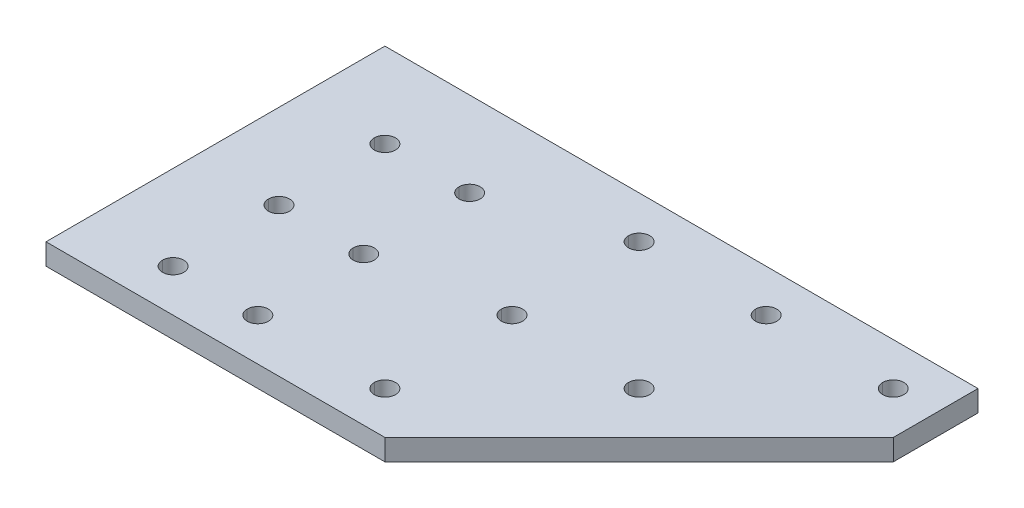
ISO-10303-21;
HEADER;
FILE_DESCRIPTION(('STEP AP214'),'2;1');
FILE_NAME('part.step','',(''),(''),'','','');
FILE_SCHEMA(('AUTOMOTIVE_DESIGN { 1 0 10303 214 1 1 1 1 }'));
ENDSEC;
DATA;
#1=APPLICATION_CONTEXT('core data for automotive mechanical design processes');
#2=APPLICATION_PROTOCOL_DEFINITION('international standard','automotive_design',2000,#1);
#3=PRODUCT_CONTEXT('',#1,'mechanical');
#4=PRODUCT('Part','Part','',(#3));
#5=PRODUCT_RELATED_PRODUCT_CATEGORY('part','',(#4));
#6=PRODUCT_DEFINITION_FORMATION('','',#4);
#7=PRODUCT_DEFINITION_CONTEXT('part definition',#1,'design');
#8=PRODUCT_DEFINITION('design','',#6,#7);
#9=PRODUCT_DEFINITION_SHAPE('','',#8);
#10=(LENGTH_UNIT() NAMED_UNIT(*) SI_UNIT(.MILLI.,.METRE.));
#11=(NAMED_UNIT(*) PLANE_ANGLE_UNIT() SI_UNIT($,.RADIAN.));
#12=(NAMED_UNIT(*) SI_UNIT($,.STERADIAN.) SOLID_ANGLE_UNIT());
#13=UNCERTAINTY_MEASURE_WITH_UNIT(LENGTH_MEASURE(1.E-05),#10,'distance_accuracy_value','');
#14=(GEOMETRIC_REPRESENTATION_CONTEXT(3) GLOBAL_UNCERTAINTY_ASSIGNED_CONTEXT((#13)) GLOBAL_UNIT_ASSIGNED_CONTEXT((#10,
#11,#12)) REPRESENTATION_CONTEXT('',''));
#15=CARTESIAN_POINT('',(0.,0.,0.));
#16=DIRECTION('',(0.,0.,1.));
#17=DIRECTION('',(1.,0.,0.));
#18=AXIS2_PLACEMENT_3D('',#15,#16,#17);
#19=CARTESIAN_POINT('',(25.4,6.35,-101.6));
#20=DIRECTION('',(0.,-1.,0.));
#21=DIRECTION('',(0.,0.,-1.));
#22=AXIS2_PLACEMENT_3D('',#19,#20,#21);
#23=PLANE('',#22);
#24=CARTESIAN_POINT('',(152.4,6.35,-76.2));
#25=DIRECTION('',(0.,-1.,0.));
#26=DIRECTION('',(0.,0.,-1.));
#27=AXIS2_PLACEMENT_3D('',#24,#25,#26);
#28=CIRCLE('',#27,6.34999999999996);
#29=CARTESIAN_POINT('',(146.05,6.35,-76.2));
#30=VERTEX_POINT('',#29);
#31=CARTESIAN_POINT('',(158.75,6.35,-76.2));
#32=VERTEX_POINT('',#31);
#33=EDGE_CURVE('E257',#30,#32,#28,.T.);
#34=ORIENTED_EDGE('',*,*,#33,.T.);
#35=CARTESIAN_POINT('',(152.4,6.35,-76.2));
#36=DIRECTION('',(0.,-1.,0.));
#37=DIRECTION('',(0.,0.,-1.));
#38=AXIS2_PLACEMENT_3D('',#35,#36,#37);
#39=CIRCLE('',#38,6.34999999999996);
#40=EDGE_CURVE('E259',#32,#30,#39,.T.);
#41=ORIENTED_EDGE('',*,*,#40,.T.);
#42=EDGE_LOOP('',(#34,#41));
#43=FACE_BOUND('',#42,.T.);
#44=CARTESIAN_POINT('',(-127.,6.35,76.2));
#45=DIRECTION('',(0.,-1.,0.));
#46=DIRECTION('',(0.,0.,-1.));
#47=AXIS2_PLACEMENT_3D('',#44,#45,#46);
#48=CIRCLE('',#47,6.35);
#49=CARTESIAN_POINT('',(-133.35,6.35,76.2));
#50=VERTEX_POINT('',#49);
#51=CARTESIAN_POINT('',(-120.65,6.35,76.2));
#52=VERTEX_POINT('',#51);
#53=EDGE_CURVE('E254',#50,#52,#48,.T.);
#54=ORIENTED_EDGE('',*,*,#53,.T.);
#55=CARTESIAN_POINT('',(-127.,6.35,76.2));
#56=DIRECTION('',(0.,-1.,0.));
#57=DIRECTION('',(0.,0.,-1.));
#58=AXIS2_PLACEMENT_3D('',#55,#56,#57);
#59=CIRCLE('',#58,6.35);
#60=EDGE_CURVE('E251',#52,#50,#59,.T.);
#61=ORIENTED_EDGE('',*,*,#60,.T.);
#62=EDGE_LOOP('',(#54,#61));
#63=FACE_BOUND('',#62,.T.);
#64=CARTESIAN_POINT('',(0.,6.35,0.));
#65=DIRECTION('',(0.,-1.,0.));
#66=DIRECTION('',(0.,0.,-1.));
#67=AXIS2_PLACEMENT_3D('',#64,#65,#66);
#68=CIRCLE('',#67,6.35);
#69=CARTESIAN_POINT('',(-6.35,6.35,0.));
#70=VERTEX_POINT('',#69);
#71=CARTESIAN_POINT('',(6.35,6.35,0.));
#72=VERTEX_POINT('',#71);
#73=EDGE_CURVE('E248',#70,#72,#68,.T.);
#74=ORIENTED_EDGE('',*,*,#73,.T.);
#75=CARTESIAN_POINT('',(0.,6.35,0.));
#76=DIRECTION('',(0.,-1.,0.));
#77=DIRECTION('',(0.,0.,-1.));
#78=AXIS2_PLACEMENT_3D('',#75,#76,#77);
#79=CIRCLE('',#78,6.35);
#80=EDGE_CURVE('E245',#72,#70,#79,.T.);
#81=ORIENTED_EDGE('',*,*,#80,.T.);
#82=EDGE_LOOP('',(#74,#81));
#83=FACE_BOUND('',#82,.T.);
#84=CARTESIAN_POINT('',(-76.2,6.35,76.2));
#85=DIRECTION('',(0.,-1.,0.));
#86=DIRECTION('',(0.,0.,-1.));
#87=AXIS2_PLACEMENT_3D('',#84,#85,#86);
#88=CIRCLE('',#87,6.35);
#89=CARTESIAN_POINT('',(-82.55,6.35,76.2));
#90=VERTEX_POINT('',#89);
#91=CARTESIAN_POINT('',(-69.85,6.35,76.2));
#92=VERTEX_POINT('',#91);
#93=EDGE_CURVE('E242',#90,#92,#88,.T.);
#94=ORIENTED_EDGE('',*,*,#93,.T.);
#95=CARTESIAN_POINT('',(-76.2,6.35,76.2));
#96=DIRECTION('',(0.,-1.,0.));
#97=DIRECTION('',(0.,0.,-1.));
#98=AXIS2_PLACEMENT_3D('',#95,#96,#97);
#99=CIRCLE('',#98,6.35);
#100=EDGE_CURVE('E239',#92,#90,#99,.T.);
#101=ORIENTED_EDGE('',*,*,#100,.T.);
#102=EDGE_LOOP('',(#94,#101));
#103=FACE_BOUND('',#102,.T.);
#104=CARTESIAN_POINT('',(0.,6.35,76.2));
#105=DIRECTION('',(0.,-1.,0.));
#106=DIRECTION('',(0.,0.,-1.));
#107=AXIS2_PLACEMENT_3D('',#104,#105,#106);
#108=CIRCLE('',#107,6.35);
#109=CARTESIAN_POINT('',(-6.35,6.35,76.2));
#110=VERTEX_POINT('',#109);
#111=CARTESIAN_POINT('',(6.35,6.35,76.2));
#112=VERTEX_POINT('',#111);
#113=EDGE_CURVE('E236',#110,#112,#108,.T.);
#114=ORIENTED_EDGE('',*,*,#113,.T.);
#115=CARTESIAN_POINT('',(0.,6.35,76.2));
#116=DIRECTION('',(0.,-1.,0.));
#117=DIRECTION('',(0.,0.,-1.));
#118=AXIS2_PLACEMENT_3D('',#115,#116,#117);
#119=CIRCLE('',#118,6.35);
#120=EDGE_CURVE('E233',#112,#110,#119,.T.);
#121=ORIENTED_EDGE('',*,*,#120,.T.);
#122=EDGE_LOOP('',(#114,#121));
#123=FACE_BOUND('',#122,.T.);
#124=CARTESIAN_POINT('',(0.,6.35,-76.2));
#125=DIRECTION('',(0.,-1.,0.));
#126=DIRECTION('',(0.,0.,-1.));
#127=AXIS2_PLACEMENT_3D('',#124,#125,#126);
#128=CIRCLE('',#127,6.35);
#129=CARTESIAN_POINT('',(-6.35,6.35,-76.2));
#130=VERTEX_POINT('',#129);
#131=CARTESIAN_POINT('',(6.35,6.35,-76.2));
#132=VERTEX_POINT('',#131);
#133=EDGE_CURVE('E230',#130,#132,#128,.T.);
#134=ORIENTED_EDGE('',*,*,#133,.T.);
#135=CARTESIAN_POINT('',(0.,6.35,-76.2));
#136=DIRECTION('',(0.,-1.,0.));
#137=DIRECTION('',(0.,0.,-1.));
#138=AXIS2_PLACEMENT_3D('',#135,#136,#137);
#139=CIRCLE('',#138,6.35);
#140=EDGE_CURVE('E226',#132,#130,#139,.T.);
#141=ORIENTED_EDGE('',*,*,#140,.T.);
#142=EDGE_LOOP('',(#134,#141));
#143=FACE_BOUND('',#142,.T.);
#144=DIRECTION('',(-1.,0.,0.));
#145=VECTOR('',#144,1.);
#146=CARTESIAN_POINT('',(228.6,6.35,-101.6));
#147=LINE('',#146,#145);
#148=CARTESIAN_POINT('',(-177.8,6.35,-101.6));
#149=VERTEX_POINT('',#148);
#150=CARTESIAN_POINT('',(177.8,6.35,-101.6));
#151=VERTEX_POINT('',#150);
#152=EDGE_CURVE('E229',#149,#151,#147,.F.);
#153=ORIENTED_EDGE('',*,*,#152,.F.);
#154=DIRECTION('',(0.,0.,1.));
#155=VECTOR('',#154,1.);
#156=CARTESIAN_POINT('',(-177.8,6.35,-101.6));
#157=LINE('',#156,#155);
#158=CARTESIAN_POINT('',(-177.8,6.35,101.6));
#159=VERTEX_POINT('',#158);
#160=EDGE_CURVE('E360',#159,#149,#157,.F.);
#161=ORIENTED_EDGE('',*,*,#160,.F.);
#162=DIRECTION('',(1.,0.,0.));
#163=VECTOR('',#162,1.);
#164=CARTESIAN_POINT('',(-177.8,6.35,101.6));
#165=LINE('',#164,#163);
#166=CARTESIAN_POINT('',(25.4,6.35,101.6));
#167=VERTEX_POINT('',#166);
#168=EDGE_CURVE('E354',#167,#159,#165,.F.);
#169=ORIENTED_EDGE('',*,*,#168,.F.);
#170=DIRECTION('',(0.707106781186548,0.,-0.707106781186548));
#171=VECTOR('',#170,1.);
#172=CARTESIAN_POINT('',(25.4,6.35000000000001,101.6));
#173=LINE('',#172,#171);
#174=CARTESIAN_POINT('',(177.8,6.35,-50.8));
#175=VERTEX_POINT('',#174);
#176=EDGE_CURVE('E351',#175,#167,#173,.F.);
#177=ORIENTED_EDGE('',*,*,#176,.F.);
#178=DIRECTION('',(0.,0.,-1.));
#179=VECTOR('',#178,1.);
#180=CARTESIAN_POINT('',(177.8,6.35,-63.5));
#181=LINE('',#180,#179);
#182=EDGE_CURVE('E344',#151,#175,#181,.F.);
#183=ORIENTED_EDGE('',*,*,#182,.F.);
#184=EDGE_LOOP('',(#153,#161,#169,#177,#183));
#185=FACE_BOUND('',#184,.T.);
#186=CARTESIAN_POINT('',(76.2,6.35,0.));
#187=DIRECTION('',(0.,1.,0.));
#188=DIRECTION('',(0.,0.,1.));
#189=AXIS2_PLACEMENT_3D('',#186,#187,#188);
#190=CIRCLE('',#189,6.35);
#191=CARTESIAN_POINT('',(82.55,6.35,0.));
#192=VERTEX_POINT('',#191);
#193=CARTESIAN_POINT('',(69.85,6.35,0.));
#194=VERTEX_POINT('',#193);
#195=EDGE_CURVE('E220',#192,#194,#190,.F.);
#196=ORIENTED_EDGE('',*,*,#195,.T.);
#197=CARTESIAN_POINT('',(76.2,6.35,0.));
#198=DIRECTION('',(0.,1.,0.));
#199=DIRECTION('',(0.,0.,1.));
#200=AXIS2_PLACEMENT_3D('',#197,#198,#199);
#201=CIRCLE('',#200,6.35);
#202=EDGE_CURVE('E222',#194,#192,#201,.F.);
#203=ORIENTED_EDGE('',*,*,#202,.T.);
#204=EDGE_LOOP('',(#196,#203));
#205=FACE_BOUND('',#204,.T.);
#206=CARTESIAN_POINT('',(76.2,6.35,-76.2));
#207=DIRECTION('',(0.,1.,0.));
#208=DIRECTION('',(0.,0.,1.));
#209=AXIS2_PLACEMENT_3D('',#206,#207,#208);
#210=CIRCLE('',#209,6.35);
#211=CARTESIAN_POINT('',(82.55,6.35,-76.2));
#212=VERTEX_POINT('',#211);
#213=CARTESIAN_POINT('',(69.85,6.35,-76.2));
#214=VERTEX_POINT('',#213);
#215=EDGE_CURVE('E214',#212,#214,#210,.F.);
#216=ORIENTED_EDGE('',*,*,#215,.T.);
#217=CARTESIAN_POINT('',(76.2,6.35,-76.2));
#218=DIRECTION('',(0.,1.,0.));
#219=DIRECTION('',(0.,0.,1.));
#220=AXIS2_PLACEMENT_3D('',#217,#218,#219);
#221=CIRCLE('',#220,6.35);
#222=EDGE_CURVE('E216',#214,#212,#221,.F.);
#223=ORIENTED_EDGE('',*,*,#222,.T.);
#224=EDGE_LOOP('',(#216,#223));
#225=FACE_BOUND('',#224,.T.);
#226=CARTESIAN_POINT('',(-127.,6.35,-50.8));
#227=DIRECTION('',(0.,1.,0.));
#228=DIRECTION('',(0.,0.,1.));
#229=AXIS2_PLACEMENT_3D('',#226,#227,#228);
#230=CIRCLE('',#229,6.35);
#231=CARTESIAN_POINT('',(-120.65,6.35,-50.8));
#232=VERTEX_POINT('',#231);
#233=CARTESIAN_POINT('',(-133.35,6.35,-50.8));
#234=VERTEX_POINT('',#233);
#235=EDGE_CURVE('E208',#232,#234,#230,.F.);
#236=ORIENTED_EDGE('',*,*,#235,.T.);
#237=CARTESIAN_POINT('',(-127.,6.35,-50.8));
#238=DIRECTION('',(0.,1.,0.));
#239=DIRECTION('',(0.,0.,1.));
#240=AXIS2_PLACEMENT_3D('',#237,#238,#239);
#241=CIRCLE('',#240,6.35);
#242=EDGE_CURVE('E210',#234,#232,#241,.F.);
#243=ORIENTED_EDGE('',*,*,#242,.T.);
#244=EDGE_LOOP('',(#236,#243));
#245=FACE_BOUND('',#244,.T.);
#246=CARTESIAN_POINT('',(-76.2,6.35,-50.8));
#247=DIRECTION('',(0.,1.,0.));
#248=DIRECTION('',(0.,0.,1.));
#249=AXIS2_PLACEMENT_3D('',#246,#247,#248);
#250=CIRCLE('',#249,6.35);
#251=CARTESIAN_POINT('',(-69.85,6.35,-50.8));
#252=VERTEX_POINT('',#251);
#253=CARTESIAN_POINT('',(-82.55,6.35,-50.8));
#254=VERTEX_POINT('',#253);
#255=EDGE_CURVE('E202',#252,#254,#250,.F.);
#256=ORIENTED_EDGE('',*,*,#255,.T.);
#257=CARTESIAN_POINT('',(-76.2,6.35,-50.8));
#258=DIRECTION('',(0.,1.,0.));
#259=DIRECTION('',(0.,0.,1.));
#260=AXIS2_PLACEMENT_3D('',#257,#258,#259);
#261=CIRCLE('',#260,6.35);
#262=EDGE_CURVE('E204',#254,#252,#261,.F.);
#263=ORIENTED_EDGE('',*,*,#262,.T.);
#264=EDGE_LOOP('',(#256,#263));
#265=FACE_BOUND('',#264,.T.);
#266=CARTESIAN_POINT('',(-127.,6.35,12.7));
#267=DIRECTION('',(0.,1.,0.));
#268=DIRECTION('',(0.,0.,1.));
#269=AXIS2_PLACEMENT_3D('',#266,#267,#268);
#270=CIRCLE('',#269,6.35);
#271=CARTESIAN_POINT('',(-120.65,6.35,12.7));
#272=VERTEX_POINT('',#271);
#273=CARTESIAN_POINT('',(-133.35,6.35,12.7));
#274=VERTEX_POINT('',#273);
#275=EDGE_CURVE('E192',#272,#274,#270,.F.);
#276=ORIENTED_EDGE('',*,*,#275,.T.);
#277=CARTESIAN_POINT('',(-127.,6.35,12.7));
#278=DIRECTION('',(0.,1.,0.));
#279=DIRECTION('',(0.,0.,1.));
#280=AXIS2_PLACEMENT_3D('',#277,#278,#279);
#281=CIRCLE('',#280,6.35);
#282=EDGE_CURVE('E199',#274,#272,#281,.F.);
#283=ORIENTED_EDGE('',*,*,#282,.T.);
#284=EDGE_LOOP('',(#276,#283));
#285=FACE_BOUND('',#284,.T.);
#286=CARTESIAN_POINT('',(-76.2,6.35,12.7));
#287=DIRECTION('',(0.,1.,0.));
#288=DIRECTION('',(0.,0.,1.));
#289=AXIS2_PLACEMENT_3D('',#286,#287,#288);
#290=CIRCLE('',#289,6.35);
#291=CARTESIAN_POINT('',(-69.85,6.35,12.7));
#292=VERTEX_POINT('',#291);
#293=CARTESIAN_POINT('',(-82.55,6.35,12.7));
#294=VERTEX_POINT('',#293);
#295=EDGE_CURVE('E19',#292,#294,#290,.F.);
#296=ORIENTED_EDGE('',*,*,#295,.T.);
#297=CARTESIAN_POINT('',(-76.2,6.35,12.7));
#298=DIRECTION('',(0.,1.,0.));
#299=DIRECTION('',(0.,0.,1.));
#300=AXIS2_PLACEMENT_3D('',#297,#298,#299);
#301=CIRCLE('',#300,6.35);
#302=EDGE_CURVE('E179',#294,#292,#301,.F.);
#303=ORIENTED_EDGE('',*,*,#302,.T.);
#304=EDGE_LOOP('',(#296,#303));
#305=FACE_BOUND('',#304,.T.);
#306=ADVANCED_FACE('F16',(#43,#63,#83,#103,#123,#143,#185,#205,#225,#245,#265,#285,#305),#23,.F.);
#307=CARTESIAN_POINT('',(-76.2,0.,12.7));
#308=DIRECTION('',(0.,1.,0.));
#309=DIRECTION('',(0.,0.,1.));
#310=AXIS2_PLACEMENT_3D('',#307,#308,#309);
#311=CYLINDRICAL_SURFACE('',#310,6.35);
#312=ORIENTED_EDGE('',*,*,#295,.F.);
#313=DIRECTION('',(0.,1.,0.));
#314=VECTOR('',#313,1.);
#315=CARTESIAN_POINT('',(-69.85,0.,12.7));
#316=LINE('',#315,#314);
#317=CARTESIAN_POINT('',(-69.85,-6.35,12.7));
#318=VERTEX_POINT('',#317);
#319=EDGE_CURVE('E193',#292,#318,#316,.F.);
#320=ORIENTED_EDGE('',*,*,#319,.T.);
#321=CARTESIAN_POINT('',(-76.2,-6.35,12.7));
#322=DIRECTION('',(0.,1.,0.));
#323=DIRECTION('',(0.,0.,1.));
#324=AXIS2_PLACEMENT_3D('',#321,#322,#323);
#325=CIRCLE('',#324,6.35);
#326=CARTESIAN_POINT('',(-82.55,-6.35,12.7));
#327=VERTEX_POINT('',#326);
#328=EDGE_CURVE('E188',#327,#318,#325,.T.);
#329=ORIENTED_EDGE('',*,*,#328,.F.);
#330=DIRECTION('',(0.,1.,0.));
#331=VECTOR('',#330,1.);
#332=CARTESIAN_POINT('',(-82.55,0.,12.7));
#333=LINE('',#332,#331);
#334=EDGE_CURVE('E185',#327,#294,#333,.T.);
#335=ORIENTED_EDGE('',*,*,#334,.T.);
#336=EDGE_LOOP('',(#312,#320,#329,#335));
#337=FACE_BOUND('',#336,.T.);
#338=ADVANCED_FACE('F186',(#337),#311,.F.);
#339=CARTESIAN_POINT('',(-76.2,0.,12.7));
#340=DIRECTION('',(0.,1.,0.));
#341=DIRECTION('',(0.,0.,1.));
#342=AXIS2_PLACEMENT_3D('',#339,#340,#341);
#343=CYLINDRICAL_SURFACE('',#342,6.35);
#344=CARTESIAN_POINT('',(-76.2,-6.35,12.7));
#345=DIRECTION('',(0.,1.,0.));
#346=DIRECTION('',(0.,0.,1.));
#347=AXIS2_PLACEMENT_3D('',#344,#345,#346);
#348=CIRCLE('',#347,6.35);
#349=EDGE_CURVE('E262',#318,#327,#348,.T.);
#350=ORIENTED_EDGE('',*,*,#349,.F.);
#351=ORIENTED_EDGE('',*,*,#319,.F.);
#352=ORIENTED_EDGE('',*,*,#302,.F.);
#353=ORIENTED_EDGE('',*,*,#334,.F.);
#354=EDGE_LOOP('',(#350,#351,#352,#353));
#355=FACE_BOUND('',#354,.T.);
#356=ADVANCED_FACE('F195',(#355),#343,.F.);
#357=CARTESIAN_POINT('',(-127.,0.,12.7));
#358=DIRECTION('',(0.,1.,0.));
#359=DIRECTION('',(0.,0.,1.));
#360=AXIS2_PLACEMENT_3D('',#357,#358,#359);
#361=CYLINDRICAL_SURFACE('',#360,6.35);
#362=ORIENTED_EDGE('',*,*,#275,.F.);
#363=DIRECTION('',(0.,1.,0.));
#364=VECTOR('',#363,1.);
#365=CARTESIAN_POINT('',(-120.65,0.,12.7));
#366=LINE('',#365,#364);
#367=CARTESIAN_POINT('',(-120.65,-6.35,12.7));
#368=VERTEX_POINT('',#367);
#369=EDGE_CURVE('E201',#272,#368,#366,.F.);
#370=ORIENTED_EDGE('',*,*,#369,.T.);
#371=CARTESIAN_POINT('',(-127.,-6.35,12.7));
#372=DIRECTION('',(0.,1.,0.));
#373=DIRECTION('',(0.,0.,1.));
#374=AXIS2_PLACEMENT_3D('',#371,#372,#373);
#375=CIRCLE('',#374,6.35);
#376=CARTESIAN_POINT('',(-133.35,-6.35,12.7));
#377=VERTEX_POINT('',#376);
#378=EDGE_CURVE('E265',#377,#368,#375,.T.);
#379=ORIENTED_EDGE('',*,*,#378,.F.);
#380=DIRECTION('',(0.,1.,0.));
#381=VECTOR('',#380,1.);
#382=CARTESIAN_POINT('',(-133.35,0.,12.7));
#383=LINE('',#382,#381);
#384=EDGE_CURVE('E205',#377,#274,#383,.T.);
#385=ORIENTED_EDGE('',*,*,#384,.T.);
#386=EDGE_LOOP('',(#362,#370,#379,#385));
#387=FACE_BOUND('',#386,.T.);
#388=ADVANCED_FACE('F557',(#387),#361,.F.);
#389=CARTESIAN_POINT('',(-127.,0.,12.7));
#390=DIRECTION('',(0.,1.,0.));
#391=DIRECTION('',(0.,0.,1.));
#392=AXIS2_PLACEMENT_3D('',#389,#390,#391);
#393=CYLINDRICAL_SURFACE('',#392,6.35);
#394=CARTESIAN_POINT('',(-127.,-6.35,12.7));
#395=DIRECTION('',(0.,1.,0.));
#396=DIRECTION('',(0.,0.,1.));
#397=AXIS2_PLACEMENT_3D('',#394,#395,#396);
#398=CIRCLE('',#397,6.35);
#399=EDGE_CURVE('E268',#368,#377,#398,.T.);
#400=ORIENTED_EDGE('',*,*,#399,.F.);
#401=ORIENTED_EDGE('',*,*,#369,.F.);
#402=ORIENTED_EDGE('',*,*,#282,.F.);
#403=ORIENTED_EDGE('',*,*,#384,.F.);
#404=EDGE_LOOP('',(#400,#401,#402,#403));
#405=FACE_BOUND('',#404,.T.);
#406=ADVANCED_FACE('F562',(#405),#393,.F.);
#407=CARTESIAN_POINT('',(-76.2,0.,-50.8));
#408=DIRECTION('',(0.,1.,0.));
#409=DIRECTION('',(0.,0.,1.));
#410=AXIS2_PLACEMENT_3D('',#407,#408,#409);
#411=CYLINDRICAL_SURFACE('',#410,6.35);
#412=ORIENTED_EDGE('',*,*,#255,.F.);
#413=DIRECTION('',(0.,1.,0.));
#414=VECTOR('',#413,1.);
#415=CARTESIAN_POINT('',(-69.85,0.,-50.8));
#416=LINE('',#415,#414);
#417=CARTESIAN_POINT('',(-69.85,-6.35,-50.8));
#418=VERTEX_POINT('',#417);
#419=EDGE_CURVE('E207',#252,#418,#416,.F.);
#420=ORIENTED_EDGE('',*,*,#419,.T.);
#421=CARTESIAN_POINT('',(-76.2,-6.35,-50.8));
#422=DIRECTION('',(0.,1.,0.));
#423=DIRECTION('',(0.,0.,1.));
#424=AXIS2_PLACEMENT_3D('',#421,#422,#423);
#425=CIRCLE('',#424,6.35);
#426=CARTESIAN_POINT('',(-82.55,-6.35,-50.8));
#427=VERTEX_POINT('',#426);
#428=EDGE_CURVE('E271',#427,#418,#425,.T.);
#429=ORIENTED_EDGE('',*,*,#428,.F.);
#430=DIRECTION('',(0.,1.,0.));
#431=VECTOR('',#430,1.);
#432=CARTESIAN_POINT('',(-82.55,0.,-50.8));
#433=LINE('',#432,#431);
#434=EDGE_CURVE('E211',#427,#254,#433,.T.);
#435=ORIENTED_EDGE('',*,*,#434,.T.);
#436=EDGE_LOOP('',(#412,#420,#429,#435));
#437=FACE_BOUND('',#436,.T.);
#438=ADVANCED_FACE('F566',(#437),#411,.F.);
#439=CARTESIAN_POINT('',(-76.2,0.,-50.8));
#440=DIRECTION('',(0.,1.,0.));
#441=DIRECTION('',(0.,0.,1.));
#442=AXIS2_PLACEMENT_3D('',#439,#440,#441);
#443=CYLINDRICAL_SURFACE('',#442,6.35);
#444=CARTESIAN_POINT('',(-76.2,-6.35,-50.8));
#445=DIRECTION('',(0.,1.,0.));
#446=DIRECTION('',(0.,0.,1.));
#447=AXIS2_PLACEMENT_3D('',#444,#445,#446);
#448=CIRCLE('',#447,6.35);
#449=EDGE_CURVE('E274',#418,#427,#448,.T.);
#450=ORIENTED_EDGE('',*,*,#449,.F.);
#451=ORIENTED_EDGE('',*,*,#419,.F.);
#452=ORIENTED_EDGE('',*,*,#262,.F.);
#453=ORIENTED_EDGE('',*,*,#434,.F.);
#454=EDGE_LOOP('',(#450,#451,#452,#453));
#455=FACE_BOUND('',#454,.T.);
#456=ADVANCED_FACE('F570',(#455),#443,.F.);
#457=CARTESIAN_POINT('',(-127.,0.,-50.8));
#458=DIRECTION('',(0.,1.,0.));
#459=DIRECTION('',(0.,0.,1.));
#460=AXIS2_PLACEMENT_3D('',#457,#458,#459);
#461=CYLINDRICAL_SURFACE('',#460,6.35);
#462=ORIENTED_EDGE('',*,*,#235,.F.);
#463=DIRECTION('',(0.,1.,0.));
#464=VECTOR('',#463,1.);
#465=CARTESIAN_POINT('',(-120.65,0.,-50.8));
#466=LINE('',#465,#464);
#467=CARTESIAN_POINT('',(-120.65,-6.35,-50.8));
#468=VERTEX_POINT('',#467);
#469=EDGE_CURVE('E213',#232,#468,#466,.F.);
#470=ORIENTED_EDGE('',*,*,#469,.T.);
#471=CARTESIAN_POINT('',(-127.,-6.35,-50.8));
#472=DIRECTION('',(0.,1.,0.));
#473=DIRECTION('',(0.,0.,1.));
#474=AXIS2_PLACEMENT_3D('',#471,#472,#473);
#475=CIRCLE('',#474,6.35);
#476=CARTESIAN_POINT('',(-133.35,-6.35,-50.8));
#477=VERTEX_POINT('',#476);
#478=EDGE_CURVE('E277',#477,#468,#475,.T.);
#479=ORIENTED_EDGE('',*,*,#478,.F.);
#480=DIRECTION('',(0.,1.,0.));
#481=VECTOR('',#480,1.);
#482=CARTESIAN_POINT('',(-133.35,0.,-50.8));
#483=LINE('',#482,#481);
#484=EDGE_CURVE('E217',#477,#234,#483,.T.);
#485=ORIENTED_EDGE('',*,*,#484,.T.);
#486=EDGE_LOOP('',(#462,#470,#479,#485));
#487=FACE_BOUND('',#486,.T.);
#488=ADVANCED_FACE('F574',(#487),#461,.F.);
#489=CARTESIAN_POINT('',(-127.,0.,-50.8));
#490=DIRECTION('',(0.,1.,0.));
#491=DIRECTION('',(0.,0.,1.));
#492=AXIS2_PLACEMENT_3D('',#489,#490,#491);
#493=CYLINDRICAL_SURFACE('',#492,6.35);
#494=CARTESIAN_POINT('',(-127.,-6.35,-50.8));
#495=DIRECTION('',(0.,1.,0.));
#496=DIRECTION('',(0.,0.,1.));
#497=AXIS2_PLACEMENT_3D('',#494,#495,#496);
#498=CIRCLE('',#497,6.35);
#499=EDGE_CURVE('E280',#468,#477,#498,.T.);
#500=ORIENTED_EDGE('',*,*,#499,.F.);
#501=ORIENTED_EDGE('',*,*,#469,.F.);
#502=ORIENTED_EDGE('',*,*,#242,.F.);
#503=ORIENTED_EDGE('',*,*,#484,.F.);
#504=EDGE_LOOP('',(#500,#501,#502,#503));
#505=FACE_BOUND('',#504,.T.);
#506=ADVANCED_FACE('F578',(#505),#493,.F.);
#507=CARTESIAN_POINT('',(76.2,0.,-76.2));
#508=DIRECTION('',(0.,1.,0.));
#509=DIRECTION('',(0.,0.,1.));
#510=AXIS2_PLACEMENT_3D('',#507,#508,#509);
#511=CYLINDRICAL_SURFACE('',#510,6.35);
#512=ORIENTED_EDGE('',*,*,#215,.F.);
#513=DIRECTION('',(0.,1.,0.));
#514=VECTOR('',#513,1.);
#515=CARTESIAN_POINT('',(82.55,0.,-76.2));
#516=LINE('',#515,#514);
#517=CARTESIAN_POINT('',(82.55,-6.35,-76.2));
#518=VERTEX_POINT('',#517);
#519=EDGE_CURVE('E219',#212,#518,#516,.F.);
#520=ORIENTED_EDGE('',*,*,#519,.T.);
#521=CARTESIAN_POINT('',(76.2,-6.35,-76.2));
#522=DIRECTION('',(0.,1.,0.));
#523=DIRECTION('',(0.,0.,1.));
#524=AXIS2_PLACEMENT_3D('',#521,#522,#523);
#525=CIRCLE('',#524,6.35);
#526=CARTESIAN_POINT('',(69.85,-6.35,-76.2));
#527=VERTEX_POINT('',#526);
#528=EDGE_CURVE('E283',#527,#518,#525,.T.);
#529=ORIENTED_EDGE('',*,*,#528,.F.);
#530=DIRECTION('',(0.,1.,0.));
#531=VECTOR('',#530,1.);
#532=CARTESIAN_POINT('',(69.85,0.,-76.2));
#533=LINE('',#532,#531);
#534=EDGE_CURVE('E223',#527,#214,#533,.T.);
#535=ORIENTED_EDGE('',*,*,#534,.T.);
#536=EDGE_LOOP('',(#512,#520,#529,#535));
#537=FACE_BOUND('',#536,.T.);
#538=ADVANCED_FACE('F582',(#537),#511,.F.);
#539=CARTESIAN_POINT('',(76.2,0.,-76.2));
#540=DIRECTION('',(0.,1.,0.));
#541=DIRECTION('',(0.,0.,1.));
#542=AXIS2_PLACEMENT_3D('',#539,#540,#541);
#543=CYLINDRICAL_SURFACE('',#542,6.35);
#544=CARTESIAN_POINT('',(76.2,-6.35,-76.2));
#545=DIRECTION('',(0.,1.,0.));
#546=DIRECTION('',(0.,0.,1.));
#547=AXIS2_PLACEMENT_3D('',#544,#545,#546);
#548=CIRCLE('',#547,6.35);
#549=EDGE_CURVE('E286',#518,#527,#548,.T.);
#550=ORIENTED_EDGE('',*,*,#549,.F.);
#551=ORIENTED_EDGE('',*,*,#519,.F.);
#552=ORIENTED_EDGE('',*,*,#222,.F.);
#553=ORIENTED_EDGE('',*,*,#534,.F.);
#554=EDGE_LOOP('',(#550,#551,#552,#553));
#555=FACE_BOUND('',#554,.T.);
#556=ADVANCED_FACE('F586',(#555),#543,.F.);
#557=CARTESIAN_POINT('',(76.2,0.,0.));
#558=DIRECTION('',(0.,1.,0.));
#559=DIRECTION('',(0.,0.,1.));
#560=AXIS2_PLACEMENT_3D('',#557,#558,#559);
#561=CYLINDRICAL_SURFACE('',#560,6.35);
#562=ORIENTED_EDGE('',*,*,#195,.F.);
#563=DIRECTION('',(0.,1.,0.));
#564=VECTOR('',#563,1.);
#565=CARTESIAN_POINT('',(82.55,0.,0.));
#566=LINE('',#565,#564);
#567=CARTESIAN_POINT('',(82.55,-6.35,0.));
#568=VERTEX_POINT('',#567);
#569=EDGE_CURVE('E225',#192,#568,#566,.F.);
#570=ORIENTED_EDGE('',*,*,#569,.T.);
#571=CARTESIAN_POINT('',(76.2,-6.35,0.));
#572=DIRECTION('',(0.,1.,0.));
#573=DIRECTION('',(0.,0.,1.));
#574=AXIS2_PLACEMENT_3D('',#571,#572,#573);
#575=CIRCLE('',#574,6.35);
#576=CARTESIAN_POINT('',(69.85,-6.35,0.));
#577=VERTEX_POINT('',#576);
#578=EDGE_CURVE('E289',#577,#568,#575,.T.);
#579=ORIENTED_EDGE('',*,*,#578,.F.);
#580=DIRECTION('',(0.,1.,0.));
#581=VECTOR('',#580,1.);
#582=CARTESIAN_POINT('',(69.85,0.,0.));
#583=LINE('',#582,#581);
#584=EDGE_CURVE('E341',#577,#194,#583,.T.);
#585=ORIENTED_EDGE('',*,*,#584,.T.);
#586=EDGE_LOOP('',(#562,#570,#579,#585));
#587=FACE_BOUND('',#586,.T.);
#588=ADVANCED_FACE('F590',(#587),#561,.F.);
#589=CARTESIAN_POINT('',(76.2,0.,0.));
#590=DIRECTION('',(0.,1.,0.));
#591=DIRECTION('',(0.,0.,1.));
#592=AXIS2_PLACEMENT_3D('',#589,#590,#591);
#593=CYLINDRICAL_SURFACE('',#592,6.35);
#594=CARTESIAN_POINT('',(76.2,-6.35,0.));
#595=DIRECTION('',(0.,1.,0.));
#596=DIRECTION('',(0.,0.,1.));
#597=AXIS2_PLACEMENT_3D('',#594,#595,#596);
#598=CIRCLE('',#597,6.35);
#599=EDGE_CURVE('E292',#568,#577,#598,.T.);
#600=ORIENTED_EDGE('',*,*,#599,.F.);
#601=ORIENTED_EDGE('',*,*,#569,.F.);
#602=ORIENTED_EDGE('',*,*,#202,.F.);
#603=ORIENTED_EDGE('',*,*,#584,.F.);
#604=EDGE_LOOP('',(#600,#601,#602,#603));
#605=FACE_BOUND('',#604,.T.);
#606=ADVANCED_FACE('F594',(#605),#593,.F.);
#607=CARTESIAN_POINT('',(177.8,0.,-63.5));
#608=DIRECTION('',(1.,0.,0.));
#609=DIRECTION('',(0.,0.,-1.));
#610=AXIS2_PLACEMENT_3D('',#607,#608,#609);
#611=PLANE('',#610);
#612=DIRECTION('',(0.,1.,0.));
#613=VECTOR('',#612,1.);
#614=CARTESIAN_POINT('',(177.8,-6.35,-101.6));
#615=LINE('',#614,#613);
#616=CARTESIAN_POINT('',(177.8,-6.35,-101.6));
#617=VERTEX_POINT('',#616);
#618=EDGE_CURVE('E366',#151,#617,#615,.F.);
#619=ORIENTED_EDGE('',*,*,#618,.F.);
#620=ORIENTED_EDGE('',*,*,#182,.T.);
#621=DIRECTION('',(0.,1.,0.));
#622=VECTOR('',#621,1.);
#623=CARTESIAN_POINT('',(177.8,-6.35,-50.8));
#624=LINE('',#623,#622);
#625=CARTESIAN_POINT('',(177.8,-6.35,-50.8));
#626=VERTEX_POINT('',#625);
#627=EDGE_CURVE('E348',#626,#175,#624,.T.);
#628=ORIENTED_EDGE('',*,*,#627,.F.);
#629=DIRECTION('',(0.,0.,-1.));
#630=VECTOR('',#629,1.);
#631=CARTESIAN_POINT('',(177.8,-6.35,-33.8666666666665));
#632=LINE('',#631,#630);
#633=EDGE_CURVE('E295',#617,#626,#632,.F.);
#634=ORIENTED_EDGE('',*,*,#633,.F.);
#635=EDGE_LOOP('',(#619,#620,#628,#634));
#636=FACE_BOUND('',#635,.T.);
#637=ADVANCED_FACE('F438',(#636),#611,.T.);
#638=CARTESIAN_POINT('',(25.4,-6.35,101.6));
#639=DIRECTION('',(0.707106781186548,0.,0.707106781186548));
#640=DIRECTION('',(0.707106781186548,0.,-0.707106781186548));
#641=AXIS2_PLACEMENT_3D('',#638,#639,#640);
#642=PLANE('',#641);
#643=DIRECTION('',(0.,1.,0.));
#644=VECTOR('',#643,1.);
#645=CARTESIAN_POINT('',(25.4,-6.35,101.6));
#646=LINE('',#645,#644);
#647=CARTESIAN_POINT('',(25.4,-6.35,101.6));
#648=VERTEX_POINT('',#647);
#649=EDGE_CURVE('E357',#648,#167,#646,.T.);
#650=ORIENTED_EDGE('',*,*,#649,.F.);
#651=DIRECTION('',(-0.707106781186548,0.,0.707106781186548));
#652=VECTOR('',#651,1.);
#653=CARTESIAN_POINT('',(177.8,-6.35,-50.8));
#654=LINE('',#653,#652);
#655=EDGE_CURVE('E394',#626,#648,#654,.T.);
#656=ORIENTED_EDGE('',*,*,#655,.F.);
#657=ORIENTED_EDGE('',*,*,#627,.T.);
#658=ORIENTED_EDGE('',*,*,#176,.T.);
#659=EDGE_LOOP('',(#650,#656,#657,#658));
#660=FACE_BOUND('',#659,.T.);
#661=ADVANCED_FACE('F444',(#660),#642,.T.);
#662=CARTESIAN_POINT('',(-177.8,-6.35,101.6));
#663=DIRECTION('',(0.,0.,1.));
#664=DIRECTION('',(1.,0.,0.));
#665=AXIS2_PLACEMENT_3D('',#662,#663,#664);
#666=PLANE('',#665);
#667=DIRECTION('',(1.,0.,0.));
#668=VECTOR('',#667,1.);
#669=CARTESIAN_POINT('',(93.1333333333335,-6.35,101.6));
#670=LINE('',#669,#668);
#671=CARTESIAN_POINT('',(-177.8,-6.35,101.6));
#672=VERTEX_POINT('',#671);
#673=EDGE_CURVE('E397',#648,#672,#670,.F.);
#674=ORIENTED_EDGE('',*,*,#673,.F.);
#675=ORIENTED_EDGE('',*,*,#649,.T.);
#676=ORIENTED_EDGE('',*,*,#168,.T.);
#677=DIRECTION('',(0.,1.,0.));
#678=VECTOR('',#677,1.);
#679=CARTESIAN_POINT('',(-177.8,-6.35,101.6));
#680=LINE('',#679,#678);
#681=EDGE_CURVE('E363',#672,#159,#680,.T.);
#682=ORIENTED_EDGE('',*,*,#681,.F.);
#683=EDGE_LOOP('',(#674,#675,#676,#682));
#684=FACE_BOUND('',#683,.T.);
#685=ADVANCED_FACE('F447',(#684),#666,.T.);
#686=CARTESIAN_POINT('',(-177.8,-6.35,-101.6));
#687=DIRECTION('',(-1.,0.,0.));
#688=DIRECTION('',(0.,0.,1.));
#689=AXIS2_PLACEMENT_3D('',#686,#687,#688);
#690=PLANE('',#689);
#691=DIRECTION('',(0.,0.,-1.));
#692=VECTOR('',#691,1.);
#693=CARTESIAN_POINT('',(-177.8,-6.35,-33.8666666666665));
#694=LINE('',#693,#692);
#695=CARTESIAN_POINT('',(-177.8,-6.35,-101.6));
#696=VERTEX_POINT('',#695);
#697=EDGE_CURVE('E400',#672,#696,#694,.T.);
#698=ORIENTED_EDGE('',*,*,#697,.F.);
#699=ORIENTED_EDGE('',*,*,#681,.T.);
#700=ORIENTED_EDGE('',*,*,#160,.T.);
#701=DIRECTION('',(0.,1.,0.));
#702=VECTOR('',#701,1.);
#703=CARTESIAN_POINT('',(-177.8,-6.35,-101.6));
#704=LINE('',#703,#702);
#705=EDGE_CURVE('E369',#696,#149,#704,.T.);
#706=ORIENTED_EDGE('',*,*,#705,.F.);
#707=EDGE_LOOP('',(#698,#699,#700,#706));
#708=FACE_BOUND('',#707,.T.);
#709=ADVANCED_FACE('F448',(#708),#690,.T.);
#710=CARTESIAN_POINT('',(228.6,-6.35,-101.6));
#711=DIRECTION('',(0.,0.,-1.));
#712=DIRECTION('',(-1.,0.,0.));
#713=AXIS2_PLACEMENT_3D('',#710,#711,#712);
#714=PLANE('',#713);
#715=ORIENTED_EDGE('',*,*,#705,.T.);
#716=ORIENTED_EDGE('',*,*,#152,.T.);
#717=ORIENTED_EDGE('',*,*,#618,.T.);
#718=DIRECTION('',(1.,0.,0.));
#719=VECTOR('',#718,1.);
#720=CARTESIAN_POINT('',(93.1333333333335,-6.35,-101.6));
#721=LINE('',#720,#719);
#722=EDGE_CURVE('E300',#696,#617,#721,.T.);
#723=ORIENTED_EDGE('',*,*,#722,.F.);
#724=EDGE_LOOP('',(#715,#716,#717,#723));
#725=FACE_BOUND('',#724,.T.);
#726=ADVANCED_FACE('F413',(#725),#714,.T.);
#727=CARTESIAN_POINT('',(0.,6.35,-76.2));
#728=DIRECTION('',(0.,-1.,0.));
#729=DIRECTION('',(0.,0.,-1.));
#730=AXIS2_PLACEMENT_3D('',#727,#728,#729);
#731=CYLINDRICAL_SURFACE('',#730,6.35);
#732=CARTESIAN_POINT('',(0.,-6.35,-76.2));
#733=DIRECTION('',(0.,-1.,0.));
#734=DIRECTION('',(0.,0.,-1.));
#735=AXIS2_PLACEMENT_3D('',#732,#733,#734);
#736=CIRCLE('',#735,6.35);
#737=CARTESIAN_POINT('',(-6.35,-6.35,-76.2));
#738=VERTEX_POINT('',#737);
#739=CARTESIAN_POINT('',(6.35,-6.35,-76.2));
#740=VERTEX_POINT('',#739);
#741=EDGE_CURVE('E296',#738,#740,#736,.F.);
#742=ORIENTED_EDGE('',*,*,#741,.F.);
#743=DIRECTION('',(0.,-1.,0.));
#744=VECTOR('',#743,1.);
#745=CARTESIAN_POINT('',(-6.35,6.35,-76.2));
#746=LINE('',#745,#744);
#747=EDGE_CURVE('E228',#738,#130,#746,.F.);
#748=ORIENTED_EDGE('',*,*,#747,.T.);
#749=ORIENTED_EDGE('',*,*,#140,.F.);
#750=DIRECTION('',(0.,-1.,0.));
#751=VECTOR('',#750,1.);
#752=CARTESIAN_POINT('',(6.35,6.35,-76.2));
#753=LINE('',#752,#751);
#754=EDGE_CURVE('E232',#132,#740,#753,.T.);
#755=ORIENTED_EDGE('',*,*,#754,.T.);
#756=EDGE_LOOP('',(#742,#748,#749,#755));
#757=FACE_BOUND('',#756,.T.);
#758=ADVANCED_FACE('F456',(#757),#731,.F.);
#759=CARTESIAN_POINT('',(0.,6.35,-76.2));
#760=DIRECTION('',(0.,-1.,0.));
#761=DIRECTION('',(0.,0.,-1.));
#762=AXIS2_PLACEMENT_3D('',#759,#760,#761);
#763=CYLINDRICAL_SURFACE('',#762,6.35);
#764=ORIENTED_EDGE('',*,*,#133,.F.);
#765=ORIENTED_EDGE('',*,*,#747,.F.);
#766=CARTESIAN_POINT('',(0.,-6.35,-76.2));
#767=DIRECTION('',(0.,-1.,0.));
#768=DIRECTION('',(0.,0.,-1.));
#769=AXIS2_PLACEMENT_3D('',#766,#767,#768);
#770=CIRCLE('',#769,6.35);
#771=EDGE_CURVE('E299',#740,#738,#770,.F.);
#772=ORIENTED_EDGE('',*,*,#771,.F.);
#773=ORIENTED_EDGE('',*,*,#754,.F.);
#774=EDGE_LOOP('',(#764,#765,#772,#773));
#775=FACE_BOUND('',#774,.T.);
#776=ADVANCED_FACE('F504',(#775),#763,.F.);
#777=CARTESIAN_POINT('',(0.,6.35,76.2));
#778=DIRECTION('',(0.,-1.,0.));
#779=DIRECTION('',(0.,0.,-1.));
#780=AXIS2_PLACEMENT_3D('',#777,#778,#779);
#781=CYLINDRICAL_SURFACE('',#780,6.35);
#782=CARTESIAN_POINT('',(0.,-6.35,76.2));
#783=DIRECTION('',(0.,-1.,0.));
#784=DIRECTION('',(0.,0.,-1.));
#785=AXIS2_PLACEMENT_3D('',#782,#783,#784);
#786=CIRCLE('',#785,6.35);
#787=CARTESIAN_POINT('',(-6.35,-6.35,76.2));
#788=VERTEX_POINT('',#787);
#789=CARTESIAN_POINT('',(6.35,-6.35,76.2));
#790=VERTEX_POINT('',#789);
#791=EDGE_CURVE('E303',#788,#790,#786,.F.);
#792=ORIENTED_EDGE('',*,*,#791,.F.);
#793=DIRECTION('',(0.,-1.,0.));
#794=VECTOR('',#793,1.);
#795=CARTESIAN_POINT('',(-6.35,6.35,76.2));
#796=LINE('',#795,#794);
#797=EDGE_CURVE('E235',#788,#110,#796,.F.);
#798=ORIENTED_EDGE('',*,*,#797,.T.);
#799=ORIENTED_EDGE('',*,*,#120,.F.);
#800=DIRECTION('',(0.,-1.,0.));
#801=VECTOR('',#800,1.);
#802=CARTESIAN_POINT('',(6.35,6.35,76.2));
#803=LINE('',#802,#801);
#804=EDGE_CURVE('E238',#112,#790,#803,.T.);
#805=ORIENTED_EDGE('',*,*,#804,.T.);
#806=EDGE_LOOP('',(#792,#798,#799,#805));
#807=FACE_BOUND('',#806,.T.);
#808=ADVANCED_FACE('F500',(#807),#781,.F.);
#809=CARTESIAN_POINT('',(0.,6.35,76.2));
#810=DIRECTION('',(0.,-1.,0.));
#811=DIRECTION('',(0.,0.,-1.));
#812=AXIS2_PLACEMENT_3D('',#809,#810,#811);
#813=CYLINDRICAL_SURFACE('',#812,6.35);
#814=ORIENTED_EDGE('',*,*,#113,.F.);
#815=ORIENTED_EDGE('',*,*,#797,.F.);
#816=CARTESIAN_POINT('',(0.,-6.35,76.2));
#817=DIRECTION('',(0.,-1.,0.));
#818=DIRECTION('',(0.,0.,-1.));
#819=AXIS2_PLACEMENT_3D('',#816,#817,#818);
#820=CIRCLE('',#819,6.35);
#821=EDGE_CURVE('E306',#790,#788,#820,.F.);
#822=ORIENTED_EDGE('',*,*,#821,.F.);
#823=ORIENTED_EDGE('',*,*,#804,.F.);
#824=EDGE_LOOP('',(#814,#815,#822,#823));
#825=FACE_BOUND('',#824,.T.);
#826=ADVANCED_FACE('F496',(#825),#813,.F.);
#827=CARTESIAN_POINT('',(-76.2,6.35,76.2));
#828=DIRECTION('',(0.,-1.,0.));
#829=DIRECTION('',(0.,0.,-1.));
#830=AXIS2_PLACEMENT_3D('',#827,#828,#829);
#831=CYLINDRICAL_SURFACE('',#830,6.35);
#832=CARTESIAN_POINT('',(-76.2,-6.35,76.2));
#833=DIRECTION('',(0.,-1.,0.));
#834=DIRECTION('',(0.,0.,-1.));
#835=AXIS2_PLACEMENT_3D('',#832,#833,#834);
#836=CIRCLE('',#835,6.35);
#837=CARTESIAN_POINT('',(-82.55,-6.35,76.2));
#838=VERTEX_POINT('',#837);
#839=CARTESIAN_POINT('',(-69.85,-6.35,76.2));
#840=VERTEX_POINT('',#839);
#841=EDGE_CURVE('E309',#838,#840,#836,.F.);
#842=ORIENTED_EDGE('',*,*,#841,.F.);
#843=DIRECTION('',(0.,-1.,0.));
#844=VECTOR('',#843,1.);
#845=CARTESIAN_POINT('',(-82.55,6.35,76.2));
#846=LINE('',#845,#844);
#847=EDGE_CURVE('E241',#838,#90,#846,.F.);
#848=ORIENTED_EDGE('',*,*,#847,.T.);
#849=ORIENTED_EDGE('',*,*,#100,.F.);
#850=DIRECTION('',(0.,-1.,0.));
#851=VECTOR('',#850,1.);
#852=CARTESIAN_POINT('',(-69.85,6.35,76.2));
#853=LINE('',#852,#851);
#854=EDGE_CURVE('E244',#92,#840,#853,.T.);
#855=ORIENTED_EDGE('',*,*,#854,.T.);
#856=EDGE_LOOP('',(#842,#848,#849,#855));
#857=FACE_BOUND('',#856,.T.);
#858=ADVANCED_FACE('F492',(#857),#831,.F.);
#859=CARTESIAN_POINT('',(-76.2,6.35,76.2));
#860=DIRECTION('',(0.,-1.,0.));
#861=DIRECTION('',(0.,0.,-1.));
#862=AXIS2_PLACEMENT_3D('',#859,#860,#861);
#863=CYLINDRICAL_SURFACE('',#862,6.35);
#864=ORIENTED_EDGE('',*,*,#93,.F.);
#865=ORIENTED_EDGE('',*,*,#847,.F.);
#866=CARTESIAN_POINT('',(-76.2,-6.35,76.2));
#867=DIRECTION('',(0.,-1.,0.));
#868=DIRECTION('',(0.,0.,-1.));
#869=AXIS2_PLACEMENT_3D('',#866,#867,#868);
#870=CIRCLE('',#869,6.35);
#871=EDGE_CURVE('E312',#840,#838,#870,.F.);
#872=ORIENTED_EDGE('',*,*,#871,.F.);
#873=ORIENTED_EDGE('',*,*,#854,.F.);
#874=EDGE_LOOP('',(#864,#865,#872,#873));
#875=FACE_BOUND('',#874,.T.);
#876=ADVANCED_FACE('F488',(#875),#863,.F.);
#877=CARTESIAN_POINT('',(0.,6.35,0.));
#878=DIRECTION('',(0.,-1.,0.));
#879=DIRECTION('',(0.,0.,-1.));
#880=AXIS2_PLACEMENT_3D('',#877,#878,#879);
#881=CYLINDRICAL_SURFACE('',#880,6.35);
#882=CARTESIAN_POINT('',(0.,-6.35,0.));
#883=DIRECTION('',(0.,-1.,0.));
#884=DIRECTION('',(0.,0.,-1.));
#885=AXIS2_PLACEMENT_3D('',#882,#883,#884);
#886=CIRCLE('',#885,6.35);
#887=CARTESIAN_POINT('',(-6.35,-6.35,0.));
#888=VERTEX_POINT('',#887);
#889=CARTESIAN_POINT('',(6.35,-6.35,0.));
#890=VERTEX_POINT('',#889);
#891=EDGE_CURVE('E315',#888,#890,#886,.F.);
#892=ORIENTED_EDGE('',*,*,#891,.F.);
#893=DIRECTION('',(0.,-1.,0.));
#894=VECTOR('',#893,1.);
#895=CARTESIAN_POINT('',(-6.35,6.35,0.));
#896=LINE('',#895,#894);
#897=EDGE_CURVE('E247',#888,#70,#896,.F.);
#898=ORIENTED_EDGE('',*,*,#897,.T.);
#899=ORIENTED_EDGE('',*,*,#80,.F.);
#900=DIRECTION('',(0.,-1.,0.));
#901=VECTOR('',#900,1.);
#902=CARTESIAN_POINT('',(6.35,6.35,0.));
#903=LINE('',#902,#901);
#904=EDGE_CURVE('E250',#72,#890,#903,.T.);
#905=ORIENTED_EDGE('',*,*,#904,.T.);
#906=EDGE_LOOP('',(#892,#898,#899,#905));
#907=FACE_BOUND('',#906,.T.);
#908=ADVANCED_FACE('F484',(#907),#881,.F.);
#909=CARTESIAN_POINT('',(0.,6.35,0.));
#910=DIRECTION('',(0.,-1.,0.));
#911=DIRECTION('',(0.,0.,-1.));
#912=AXIS2_PLACEMENT_3D('',#909,#910,#911);
#913=CYLINDRICAL_SURFACE('',#912,6.35);
#914=ORIENTED_EDGE('',*,*,#73,.F.);
#915=ORIENTED_EDGE('',*,*,#897,.F.);
#916=CARTESIAN_POINT('',(0.,-6.35,0.));
#917=DIRECTION('',(0.,-1.,0.));
#918=DIRECTION('',(0.,0.,-1.));
#919=AXIS2_PLACEMENT_3D('',#916,#917,#918);
#920=CIRCLE('',#919,6.35);
#921=EDGE_CURVE('E318',#890,#888,#920,.F.);
#922=ORIENTED_EDGE('',*,*,#921,.F.);
#923=ORIENTED_EDGE('',*,*,#904,.F.);
#924=EDGE_LOOP('',(#914,#915,#922,#923));
#925=FACE_BOUND('',#924,.T.);
#926=ADVANCED_FACE('F480',(#925),#913,.F.);
#927=CARTESIAN_POINT('',(-127.,6.35,76.2));
#928=DIRECTION('',(0.,-1.,0.));
#929=DIRECTION('',(0.,0.,-1.));
#930=AXIS2_PLACEMENT_3D('',#927,#928,#929);
#931=CYLINDRICAL_SURFACE('',#930,6.35);
#932=CARTESIAN_POINT('',(-127.,-6.35,76.2));
#933=DIRECTION('',(0.,-1.,0.));
#934=DIRECTION('',(0.,0.,-1.));
#935=AXIS2_PLACEMENT_3D('',#932,#933,#934);
#936=CIRCLE('',#935,6.35);
#937=CARTESIAN_POINT('',(-133.35,-6.35,76.2));
#938=VERTEX_POINT('',#937);
#939=CARTESIAN_POINT('',(-120.65,-6.35,76.2));
#940=VERTEX_POINT('',#939);
#941=EDGE_CURVE('E321',#938,#940,#936,.F.);
#942=ORIENTED_EDGE('',*,*,#941,.F.);
#943=DIRECTION('',(0.,-1.,0.));
#944=VECTOR('',#943,1.);
#945=CARTESIAN_POINT('',(-133.35,6.35,76.2));
#946=LINE('',#945,#944);
#947=EDGE_CURVE('E253',#938,#50,#946,.F.);
#948=ORIENTED_EDGE('',*,*,#947,.T.);
#949=ORIENTED_EDGE('',*,*,#60,.F.);
#950=DIRECTION('',(0.,-1.,0.));
#951=VECTOR('',#950,1.);
#952=CARTESIAN_POINT('',(-120.65,6.35,76.2));
#953=LINE('',#952,#951);
#954=EDGE_CURVE('E256',#52,#940,#953,.T.);
#955=ORIENTED_EDGE('',*,*,#954,.T.);
#956=EDGE_LOOP('',(#942,#948,#949,#955));
#957=FACE_BOUND('',#956,.T.);
#958=ADVANCED_FACE('F476',(#957),#931,.F.);
#959=CARTESIAN_POINT('',(-127.,6.35,76.2));
#960=DIRECTION('',(0.,-1.,0.));
#961=DIRECTION('',(0.,0.,-1.));
#962=AXIS2_PLACEMENT_3D('',#959,#960,#961);
#963=CYLINDRICAL_SURFACE('',#962,6.35);
#964=ORIENTED_EDGE('',*,*,#53,.F.);
#965=ORIENTED_EDGE('',*,*,#947,.F.);
#966=CARTESIAN_POINT('',(-127.,-6.35,76.2));
#967=DIRECTION('',(0.,-1.,0.));
#968=DIRECTION('',(0.,0.,-1.));
#969=AXIS2_PLACEMENT_3D('',#966,#967,#968);
#970=CIRCLE('',#969,6.35);
#971=EDGE_CURVE('E324',#940,#938,#970,.F.);
#972=ORIENTED_EDGE('',*,*,#971,.F.);
#973=ORIENTED_EDGE('',*,*,#954,.F.);
#974=EDGE_LOOP('',(#964,#965,#972,#973));
#975=FACE_BOUND('',#974,.T.);
#976=ADVANCED_FACE('F473',(#975),#963,.F.);
#977=CARTESIAN_POINT('',(152.4,-6.35,-76.2));
#978=DIRECTION('',(0.,-1.,0.));
#979=DIRECTION('',(0.,0.,-1.));
#980=AXIS2_PLACEMENT_3D('',#977,#978,#979);
#981=CYLINDRICAL_SURFACE('',#980,6.34999999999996);
#982=ORIENTED_EDGE('',*,*,#33,.F.);
#983=DIRECTION('',(0.,-1.,0.));
#984=VECTOR('',#983,1.);
#985=CARTESIAN_POINT('',(146.05,-6.35,-76.2));
#986=LINE('',#985,#984);
#987=CARTESIAN_POINT('',(146.05,-6.35,-76.2));
#988=VERTEX_POINT('',#987);
#989=EDGE_CURVE('E34',#30,#988,#986,.T.);
#990=ORIENTED_EDGE('',*,*,#989,.T.);
#991=CARTESIAN_POINT('',(152.4,-6.35,-76.2));
#992=DIRECTION('',(0.,-1.,0.));
#993=DIRECTION('',(0.,0.,-1.));
#994=AXIS2_PLACEMENT_3D('',#991,#992,#993);
#995=CIRCLE('',#994,6.34999999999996);
#996=CARTESIAN_POINT('',(158.75,-6.35,-76.2));
#997=VERTEX_POINT('',#996);
#998=EDGE_CURVE('E25',#997,#988,#995,.F.);
#999=ORIENTED_EDGE('',*,*,#998,.F.);
#1000=DIRECTION('',(0.,-1.,0.));
#1001=VECTOR('',#1000,1.);
#1002=CARTESIAN_POINT('',(158.75,-6.35,-76.2));
#1003=LINE('',#1002,#1001);
#1004=EDGE_CURVE('E263',#997,#32,#1003,.F.);
#1005=ORIENTED_EDGE('',*,*,#1004,.T.);
#1006=EDGE_LOOP('',(#982,#990,#999,#1005));
#1007=FACE_BOUND('',#1006,.T.);
#1008=ADVANCED_FACE('F466',(#1007),#981,.F.);
#1009=CARTESIAN_POINT('',(152.4,-6.35,-76.2));
#1010=DIRECTION('',(0.,-1.,0.));
#1011=DIRECTION('',(0.,0.,-1.));
#1012=AXIS2_PLACEMENT_3D('',#1009,#1010,#1011);
#1013=CYLINDRICAL_SURFACE('',#1012,6.34999999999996);
#1014=CARTESIAN_POINT('',(152.4,-6.35,-76.2));
#1015=DIRECTION('',(0.,-1.,0.));
#1016=DIRECTION('',(0.,0.,-1.));
#1017=AXIS2_PLACEMENT_3D('',#1014,#1015,#1016);
#1018=CIRCLE('',#1017,6.34999999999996);
#1019=EDGE_CURVE('E11',#988,#997,#1018,.F.);
#1020=ORIENTED_EDGE('',*,*,#1019,.F.);
#1021=ORIENTED_EDGE('',*,*,#989,.F.);
#1022=ORIENTED_EDGE('',*,*,#40,.F.);
#1023=ORIENTED_EDGE('',*,*,#1004,.F.);
#1024=EDGE_LOOP('',(#1020,#1021,#1022,#1023));
#1025=FACE_BOUND('',#1024,.T.);
#1026=ADVANCED_FACE('F460',(#1025),#1013,.F.);
#1027=CARTESIAN_POINT('',(93.1333333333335,-6.35,-33.8666666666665));
#1028=DIRECTION('',(0.,-1.,0.));
#1029=DIRECTION('',(0.,0.,-1.));
#1030=AXIS2_PLACEMENT_3D('',#1027,#1028,#1029);
#1031=PLANE('',#1030);
#1032=ORIENTED_EDGE('',*,*,#998,.T.);
#1033=ORIENTED_EDGE('',*,*,#1019,.T.);
#1034=EDGE_LOOP('',(#1032,#1033));
#1035=FACE_BOUND('',#1034,.T.);
#1036=ORIENTED_EDGE('',*,*,#941,.T.);
#1037=ORIENTED_EDGE('',*,*,#971,.T.);
#1038=EDGE_LOOP('',(#1036,#1037));
#1039=FACE_BOUND('',#1038,.T.);
#1040=ORIENTED_EDGE('',*,*,#891,.T.);
#1041=ORIENTED_EDGE('',*,*,#921,.T.);
#1042=EDGE_LOOP('',(#1040,#1041));
#1043=FACE_BOUND('',#1042,.T.);
#1044=ORIENTED_EDGE('',*,*,#841,.T.);
#1045=ORIENTED_EDGE('',*,*,#871,.T.);
#1046=EDGE_LOOP('',(#1044,#1045));
#1047=FACE_BOUND('',#1046,.T.);
#1048=ORIENTED_EDGE('',*,*,#791,.T.);
#1049=ORIENTED_EDGE('',*,*,#821,.T.);
#1050=EDGE_LOOP('',(#1048,#1049));
#1051=FACE_BOUND('',#1050,.T.);
#1052=ORIENTED_EDGE('',*,*,#741,.T.);
#1053=ORIENTED_EDGE('',*,*,#771,.T.);
#1054=EDGE_LOOP('',(#1052,#1053));
#1055=FACE_BOUND('',#1054,.T.);
#1056=ORIENTED_EDGE('',*,*,#697,.T.);
#1057=ORIENTED_EDGE('',*,*,#722,.T.);
#1058=ORIENTED_EDGE('',*,*,#633,.T.);
#1059=ORIENTED_EDGE('',*,*,#655,.T.);
#1060=ORIENTED_EDGE('',*,*,#673,.T.);
#1061=EDGE_LOOP('',(#1056,#1057,#1058,#1059,#1060));
#1062=FACE_BOUND('',#1061,.T.);
#1063=ORIENTED_EDGE('',*,*,#578,.T.);
#1064=ORIENTED_EDGE('',*,*,#599,.T.);
#1065=EDGE_LOOP('',(#1063,#1064));
#1066=FACE_BOUND('',#1065,.T.);
#1067=ORIENTED_EDGE('',*,*,#528,.T.);
#1068=ORIENTED_EDGE('',*,*,#549,.T.);
#1069=EDGE_LOOP('',(#1067,#1068));
#1070=FACE_BOUND('',#1069,.T.);
#1071=ORIENTED_EDGE('',*,*,#478,.T.);
#1072=ORIENTED_EDGE('',*,*,#499,.T.);
#1073=EDGE_LOOP('',(#1071,#1072));
#1074=FACE_BOUND('',#1073,.T.);
#1075=ORIENTED_EDGE('',*,*,#428,.T.);
#1076=ORIENTED_EDGE('',*,*,#449,.T.);
#1077=EDGE_LOOP('',(#1075,#1076));
#1078=FACE_BOUND('',#1077,.T.);
#1079=ORIENTED_EDGE('',*,*,#378,.T.);
#1080=ORIENTED_EDGE('',*,*,#399,.T.);
#1081=EDGE_LOOP('',(#1079,#1080));
#1082=FACE_BOUND('',#1081,.T.);
#1083=ORIENTED_EDGE('',*,*,#328,.T.);
#1084=ORIENTED_EDGE('',*,*,#349,.T.);
#1085=EDGE_LOOP('',(#1083,#1084));
#1086=FACE_BOUND('',#1085,.T.);
#1087=ADVANCED_FACE('F406',(#1035,#1039,#1043,#1047,#1051,#1055,#1062,#1066,#1070,#1074,#1078,
#1082,#1086),#1031,.T.);
#1088=CLOSED_SHELL('',(#306,#338,#356,#388,#406,#438,#456,#488,#506,#538,#556,#588,#606,#637,
#661,#685,#709,#726,#758,#776,#808,#826,#858,#876,#908,#926,#958,#976,#1008,#1026,#1087));
#1089=MANIFOLD_SOLID_BREP('B1',#1088);
#1090=ADVANCED_BREP_SHAPE_REPRESENTATION('',(#18,#1089),#14);
#1091=SHAPE_DEFINITION_REPRESENTATION(#9,#1090);
ENDSEC;
END-ISO-10303-21;
